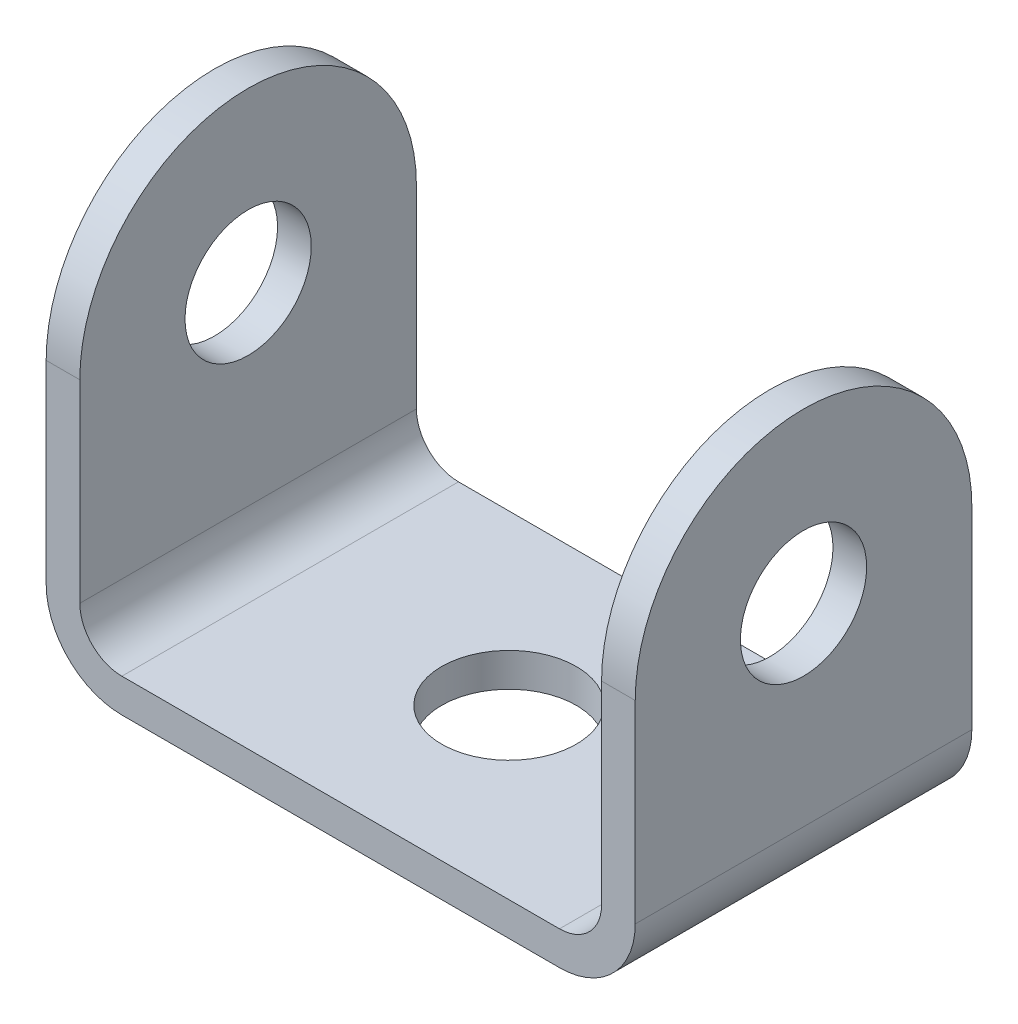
ISO-10303-21;
HEADER;
FILE_DESCRIPTION(('STEP AP214'),'2;1');
FILE_NAME('part.step','',(''),(''),'','','');
FILE_SCHEMA(('AUTOMOTIVE_DESIGN { 1 0 10303 214 1 1 1 1 }'));
ENDSEC;
DATA;
#1=APPLICATION_CONTEXT('core data for automotive mechanical design processes');
#2=APPLICATION_PROTOCOL_DEFINITION('international standard','automotive_design',2000,#1);
#3=PRODUCT_CONTEXT('',#1,'mechanical');
#4=PRODUCT('Part','Part','',(#3));
#5=PRODUCT_RELATED_PRODUCT_CATEGORY('part','',(#4));
#6=PRODUCT_DEFINITION_FORMATION('','',#4);
#7=PRODUCT_DEFINITION_CONTEXT('part definition',#1,'design');
#8=PRODUCT_DEFINITION('design','',#6,#7);
#9=PRODUCT_DEFINITION_SHAPE('','',#8);
#10=(LENGTH_UNIT() NAMED_UNIT(*) SI_UNIT(.MILLI.,.METRE.));
#11=(NAMED_UNIT(*) PLANE_ANGLE_UNIT() SI_UNIT($,.RADIAN.));
#12=(NAMED_UNIT(*) SI_UNIT($,.STERADIAN.) SOLID_ANGLE_UNIT());
#13=UNCERTAINTY_MEASURE_WITH_UNIT(LENGTH_MEASURE(1.E-05),#10,'distance_accuracy_value','');
#14=(GEOMETRIC_REPRESENTATION_CONTEXT(3) GLOBAL_UNCERTAINTY_ASSIGNED_CONTEXT((#13)) GLOBAL_UNIT_ASSIGNED_CONTEXT((#10,
#11,#12)) REPRESENTATION_CONTEXT('',''));
#15=CARTESIAN_POINT('',(0.,0.,0.));
#16=DIRECTION('',(0.,0.,1.));
#17=DIRECTION('',(1.,0.,0.));
#18=AXIS2_PLACEMENT_3D('',#15,#16,#17);
#19=CARTESIAN_POINT('',(31.,52.,20.));
#20=DIRECTION('',(1.,0.,0.));
#21=DIRECTION('',(0.,1.,0.));
#22=AXIS2_PLACEMENT_3D('',#19,#20,#21);
#23=PLANE('',#22);
#24=CARTESIAN_POINT('',(31.,32.,0.));
#25=DIRECTION('',(1.,0.,0.));
#26=DIRECTION('',(0.,1.,0.));
#27=AXIS2_PLACEMENT_3D('',#24,#25,#26);
#28=CIRCLE('',#27,7.5);
#29=CARTESIAN_POINT('',(31.,39.5,0.));
#30=VERTEX_POINT('',#29);
#31=EDGE_CURVE('E454',#30,#30,#28,.T.);
#32=ORIENTED_EDGE('',*,*,#31,.T.);
#33=EDGE_LOOP('',(#32));
#34=FACE_BOUND('',#33,.T.);
#35=DIRECTION('',(0.,-1.,0.));
#36=VECTOR('',#35,1.);
#37=CARTESIAN_POINT('',(31.,52.,20.));
#38=LINE('',#37,#36);
#39=CARTESIAN_POINT('',(31.,32.,20.));
#40=VERTEX_POINT('',#39);
#41=CARTESIAN_POINT('',(31.,9.00000000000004,20.));
#42=VERTEX_POINT('',#41);
#43=EDGE_CURVE('E520',#40,#42,#38,.T.);
#44=ORIENTED_EDGE('',*,*,#43,.F.);
#45=CARTESIAN_POINT('',(31.,32.,0.));
#46=DIRECTION('',(1.,0.,0.));
#47=DIRECTION('',(0.,1.,0.));
#48=AXIS2_PLACEMENT_3D('',#45,#46,#47);
#49=CIRCLE('',#48,20.);
#50=CARTESIAN_POINT('',(31.,32.,-20.));
#51=VERTEX_POINT('',#50);
#52=EDGE_CURVE('E438',#40,#51,#49,.F.);
#53=ORIENTED_EDGE('',*,*,#52,.T.);
#54=DIRECTION('',(0.,-1.,0.));
#55=VECTOR('',#54,1.);
#56=CARTESIAN_POINT('',(31.,52.,-20.));
#57=LINE('',#56,#55);
#58=CARTESIAN_POINT('',(31.,9.00000000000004,-20.));
#59=VERTEX_POINT('',#58);
#60=EDGE_CURVE('E498',#51,#59,#57,.T.);
#61=ORIENTED_EDGE('',*,*,#60,.T.);
#62=DIRECTION('',(0.,0.,-1.));
#63=VECTOR('',#62,1.);
#64=CARTESIAN_POINT('',(31.,9.00000000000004,20.));
#65=LINE('',#64,#63);
#66=EDGE_CURVE('E357',#42,#59,#65,.T.);
#67=ORIENTED_EDGE('',*,*,#66,.F.);
#68=EDGE_LOOP('',(#44,#53,#61,#67));
#69=FACE_BOUND('',#68,.T.);
#70=ADVANCED_FACE('F350',(#34,#69),#23,.F.);
#71=CARTESIAN_POINT('',(26.,9.,20.));
#72=DIRECTION('',(0.,0.,-1.));
#73=DIRECTION('',(-1.,0.,0.));
#74=AXIS2_PLACEMENT_3D('',#71,#72,#73);
#75=CYLINDRICAL_SURFACE('',#74,5.);
#76=CARTESIAN_POINT('',(26.,9.,-20.));
#77=DIRECTION('',(0.,0.,-1.));
#78=DIRECTION('',(-1.,0.,0.));
#79=AXIS2_PLACEMENT_3D('',#76,#77,#78);
#80=CIRCLE('',#79,5.);
#81=CARTESIAN_POINT('',(26.,4.,-20.));
#82=VERTEX_POINT('',#81);
#83=EDGE_CURVE('E491',#59,#82,#80,.T.);
#84=ORIENTED_EDGE('',*,*,#83,.T.);
#85=DIRECTION('',(0.,0.,-1.));
#86=VECTOR('',#85,1.);
#87=CARTESIAN_POINT('',(26.,4.,20.));
#88=LINE('',#87,#86);
#89=CARTESIAN_POINT('',(26.,4.,20.));
#90=VERTEX_POINT('',#89);
#91=EDGE_CURVE('E482',#90,#82,#88,.T.);
#92=ORIENTED_EDGE('',*,*,#91,.F.);
#93=CARTESIAN_POINT('',(26.,9.,20.));
#94=DIRECTION('',(0.,0.,-1.));
#95=DIRECTION('',(-1.,0.,0.));
#96=AXIS2_PLACEMENT_3D('',#93,#94,#95);
#97=CIRCLE('',#96,5.);
#98=EDGE_CURVE('E492',#42,#90,#97,.T.);
#99=ORIENTED_EDGE('',*,*,#98,.F.);
#100=ORIENTED_EDGE('',*,*,#66,.T.);
#101=EDGE_LOOP('',(#84,#92,#99,#100));
#102=FACE_BOUND('',#101,.T.);
#103=ADVANCED_FACE('F489',(#102),#75,.F.);
#104=CARTESIAN_POINT('',(26.,4.,20.));
#105=DIRECTION('',(0.,-1.,0.));
#106=DIRECTION('',(1.,0.,0.));
#107=AXIS2_PLACEMENT_3D('',#104,#105,#106);
#108=PLANE('',#107);
#109=CARTESIAN_POINT('',(0.,4.,0.));
#110=DIRECTION('',(0.,1.,0.));
#111=DIRECTION('',(-1.,0.,0.));
#112=AXIS2_PLACEMENT_3D('',#109,#110,#111);
#113=CIRCLE('',#112,8.);
#114=CARTESIAN_POINT('',(-8.,4.,0.));
#115=VERTEX_POINT('',#114);
#116=EDGE_CURVE('E562',#115,#115,#113,.T.);
#117=ORIENTED_EDGE('',*,*,#116,.F.);
#118=EDGE_LOOP('',(#117));
#119=FACE_BOUND('',#118,.T.);
#120=DIRECTION('',(-1.,0.,0.));
#121=VECTOR('',#120,1.);
#122=CARTESIAN_POINT('',(26.,4.,-20.));
#123=LINE('',#122,#121);
#124=CARTESIAN_POINT('',(-26.,3.99999999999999,-20.));
#125=VERTEX_POINT('',#124);
#126=EDGE_CURVE('E500',#82,#125,#123,.T.);
#127=ORIENTED_EDGE('',*,*,#126,.T.);
#128=DIRECTION('',(0.,0.,-1.));
#129=VECTOR('',#128,1.);
#130=CARTESIAN_POINT('',(-26.,3.99999999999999,20.));
#131=LINE('',#130,#129);
#132=CARTESIAN_POINT('',(-26.,3.99999999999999,20.));
#133=VERTEX_POINT('',#132);
#134=EDGE_CURVE('E479',#133,#125,#131,.T.);
#135=ORIENTED_EDGE('',*,*,#134,.F.);
#136=DIRECTION('',(-1.,0.,0.));
#137=VECTOR('',#136,1.);
#138=CARTESIAN_POINT('',(26.,4.,20.));
#139=LINE('',#138,#137);
#140=EDGE_CURVE('E523',#90,#133,#139,.T.);
#141=ORIENTED_EDGE('',*,*,#140,.F.);
#142=ORIENTED_EDGE('',*,*,#91,.T.);
#143=EDGE_LOOP('',(#127,#135,#141,#142));
#144=FACE_BOUND('',#143,.T.);
#145=ADVANCED_FACE('F568',(#119,#144),#108,.F.);
#146=CARTESIAN_POINT('',(-26.,8.99999999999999,20.));
#147=DIRECTION('',(0.,0.,-1.));
#148=DIRECTION('',(-1.,0.,0.));
#149=AXIS2_PLACEMENT_3D('',#146,#147,#148);
#150=CYLINDRICAL_SURFACE('',#149,5.);
#151=CARTESIAN_POINT('',(-26.,8.99999999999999,-20.));
#152=DIRECTION('',(0.,0.,-1.));
#153=DIRECTION('',(-1.,0.,0.));
#154=AXIS2_PLACEMENT_3D('',#151,#152,#153);
#155=CIRCLE('',#154,5.);
#156=CARTESIAN_POINT('',(-31.,9.00000000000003,-20.));
#157=VERTEX_POINT('',#156);
#158=EDGE_CURVE('E502',#125,#157,#155,.T.);
#159=ORIENTED_EDGE('',*,*,#158,.T.);
#160=DIRECTION('',(0.,0.,-1.));
#161=VECTOR('',#160,1.);
#162=CARTESIAN_POINT('',(-31.,9.00000000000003,20.));
#163=LINE('',#162,#161);
#164=CARTESIAN_POINT('',(-31.,9.00000000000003,20.));
#165=VERTEX_POINT('',#164);
#166=EDGE_CURVE('E476',#165,#157,#163,.T.);
#167=ORIENTED_EDGE('',*,*,#166,.F.);
#168=CARTESIAN_POINT('',(-26.,8.99999999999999,20.));
#169=DIRECTION('',(0.,0.,-1.));
#170=DIRECTION('',(-1.,0.,0.));
#171=AXIS2_PLACEMENT_3D('',#168,#169,#170);
#172=CIRCLE('',#171,5.);
#173=EDGE_CURVE('E525',#133,#165,#172,.T.);
#174=ORIENTED_EDGE('',*,*,#173,.F.);
#175=ORIENTED_EDGE('',*,*,#134,.T.);
#176=EDGE_LOOP('',(#159,#167,#174,#175));
#177=FACE_BOUND('',#176,.T.);
#178=ADVANCED_FACE('F571',(#177),#150,.F.);
#179=CARTESIAN_POINT('',(-31.,9.00000000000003,20.));
#180=DIRECTION('',(-1.,0.,0.));
#181=DIRECTION('',(0.,0.,1.));
#182=AXIS2_PLACEMENT_3D('',#179,#180,#181);
#183=PLANE('',#182);
#184=CARTESIAN_POINT('',(-31.,32.,0.));
#185=DIRECTION('',(-1.,0.,0.));
#186=DIRECTION('',(0.,0.,1.));
#187=AXIS2_PLACEMENT_3D('',#184,#185,#186);
#188=CIRCLE('',#187,7.5);
#189=CARTESIAN_POINT('',(-31.,32.,7.5));
#190=VERTEX_POINT('',#189);
#191=EDGE_CURVE('E550',#190,#190,#188,.T.);
#192=ORIENTED_EDGE('',*,*,#191,.T.);
#193=EDGE_LOOP('',(#192));
#194=FACE_BOUND('',#193,.T.);
#195=DIRECTION('',(0.,1.,0.));
#196=VECTOR('',#195,1.);
#197=CARTESIAN_POINT('',(-31.,9.00000000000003,-20.));
#198=LINE('',#197,#196);
#199=CARTESIAN_POINT('',(-31.,32.,-20.));
#200=VERTEX_POINT('',#199);
#201=EDGE_CURVE('E508',#157,#200,#198,.T.);
#202=ORIENTED_EDGE('',*,*,#201,.T.);
#203=CARTESIAN_POINT('',(-31.,32.,0.));
#204=DIRECTION('',(-1.,0.,0.));
#205=DIRECTION('',(0.,0.,1.));
#206=AXIS2_PLACEMENT_3D('',#203,#204,#205);
#207=CIRCLE('',#206,20.);
#208=CARTESIAN_POINT('',(-31.,32.,20.));
#209=VERTEX_POINT('',#208);
#210=EDGE_CURVE('E364',#200,#209,#207,.F.);
#211=ORIENTED_EDGE('',*,*,#210,.T.);
#212=DIRECTION('',(0.,1.,0.));
#213=VECTOR('',#212,1.);
#214=CARTESIAN_POINT('',(-31.,9.00000000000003,20.));
#215=LINE('',#214,#213);
#216=EDGE_CURVE('E527',#165,#209,#215,.T.);
#217=ORIENTED_EDGE('',*,*,#216,.F.);
#218=ORIENTED_EDGE('',*,*,#166,.T.);
#219=EDGE_LOOP('',(#202,#211,#217,#218));
#220=FACE_BOUND('',#219,.T.);
#221=ADVANCED_FACE('F581',(#194,#220),#183,.F.);
#222=CARTESIAN_POINT('',(-35.,9.00000000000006,20.));
#223=DIRECTION('',(1.,0.,0.));
#224=DIRECTION('',(0.,0.,-1.));
#225=AXIS2_PLACEMENT_3D('',#222,#223,#224);
#226=PLANE('',#225);
#227=CARTESIAN_POINT('',(-35.,32.,0.));
#228=DIRECTION('',(1.,0.,0.));
#229=DIRECTION('',(0.,0.,-1.));
#230=AXIS2_PLACEMENT_3D('',#227,#228,#229);
#231=CIRCLE('',#230,7.5);
#232=CARTESIAN_POINT('',(-35.,32.,-7.5));
#233=VERTEX_POINT('',#232);
#234=EDGE_CURVE('E553',#233,#233,#231,.T.);
#235=ORIENTED_EDGE('',*,*,#234,.T.);
#236=EDGE_LOOP('',(#235));
#237=FACE_BOUND('',#236,.T.);
#238=DIRECTION('',(0.,-1.,0.));
#239=VECTOR('',#238,1.);
#240=CARTESIAN_POINT('',(-35.,9.00000000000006,20.));
#241=LINE('',#240,#239);
#242=CARTESIAN_POINT('',(-35.,32.,20.));
#243=VERTEX_POINT('',#242);
#244=CARTESIAN_POINT('',(-35.,9.00000000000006,20.));
#245=VERTEX_POINT('',#244);
#246=EDGE_CURVE('E530',#243,#245,#241,.T.);
#247=ORIENTED_EDGE('',*,*,#246,.F.);
#248=CARTESIAN_POINT('',(-35.,32.,0.));
#249=DIRECTION('',(-1.,0.,0.));
#250=DIRECTION('',(0.,0.,-1.));
#251=AXIS2_PLACEMENT_3D('',#248,#249,#250);
#252=CIRCLE('',#251,20.);
#253=CARTESIAN_POINT('',(-35.,32.,-20.));
#254=VERTEX_POINT('',#253);
#255=EDGE_CURVE('E453',#243,#254,#252,.T.);
#256=ORIENTED_EDGE('',*,*,#255,.T.);
#257=DIRECTION('',(0.,-1.,0.));
#258=VECTOR('',#257,1.);
#259=CARTESIAN_POINT('',(-35.,9.00000000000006,-20.));
#260=LINE('',#259,#258);
#261=CARTESIAN_POINT('',(-35.,9.00000000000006,-20.));
#262=VERTEX_POINT('',#261);
#263=EDGE_CURVE('E511',#254,#262,#260,.T.);
#264=ORIENTED_EDGE('',*,*,#263,.T.);
#265=DIRECTION('',(0.,0.,-1.));
#266=VECTOR('',#265,1.);
#267=CARTESIAN_POINT('',(-35.,9.00000000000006,20.));
#268=LINE('',#267,#266);
#269=EDGE_CURVE('E473',#245,#262,#268,.T.);
#270=ORIENTED_EDGE('',*,*,#269,.F.);
#271=EDGE_LOOP('',(#247,#256,#264,#270));
#272=FACE_BOUND('',#271,.T.);
#273=ADVANCED_FACE('F587',(#237,#272),#226,.F.);
#274=CARTESIAN_POINT('',(-26.,9.,20.));
#275=DIRECTION('',(0.,0.,-1.));
#276=DIRECTION('',(-1.,0.,0.));
#277=AXIS2_PLACEMENT_3D('',#274,#275,#276);
#278=CYLINDRICAL_SURFACE('',#277,9.);
#279=CARTESIAN_POINT('',(-26.,9.,-20.));
#280=DIRECTION('',(0.,0.,1.));
#281=DIRECTION('',(-1.,0.,0.));
#282=AXIS2_PLACEMENT_3D('',#279,#280,#281);
#283=CIRCLE('',#282,9.);
#284=CARTESIAN_POINT('',(-25.9999999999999,0.,-20.));
#285=VERTEX_POINT('',#284);
#286=EDGE_CURVE('E513',#262,#285,#283,.T.);
#287=ORIENTED_EDGE('',*,*,#286,.T.);
#288=DIRECTION('',(0.,0.,-1.));
#289=VECTOR('',#288,1.);
#290=CARTESIAN_POINT('',(-25.9999999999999,0.,20.));
#291=LINE('',#290,#289);
#292=CARTESIAN_POINT('',(-25.9999999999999,0.,20.));
#293=VERTEX_POINT('',#292);
#294=EDGE_CURVE('E470',#293,#285,#291,.T.);
#295=ORIENTED_EDGE('',*,*,#294,.F.);
#296=CARTESIAN_POINT('',(-26.,9.,20.));
#297=DIRECTION('',(0.,0.,1.));
#298=DIRECTION('',(-1.,0.,0.));
#299=AXIS2_PLACEMENT_3D('',#296,#297,#298);
#300=CIRCLE('',#299,9.);
#301=EDGE_CURVE('E532',#245,#293,#300,.T.);
#302=ORIENTED_EDGE('',*,*,#301,.F.);
#303=ORIENTED_EDGE('',*,*,#269,.T.);
#304=EDGE_LOOP('',(#287,#295,#302,#303));
#305=FACE_BOUND('',#304,.T.);
#306=ADVANCED_FACE('F590',(#305),#278,.T.);
#307=CARTESIAN_POINT('',(-25.9999999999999,0.,20.));
#308=DIRECTION('',(0.,1.,0.));
#309=DIRECTION('',(0.,0.,1.));
#310=AXIS2_PLACEMENT_3D('',#307,#308,#309);
#311=PLANE('',#310);
#312=CARTESIAN_POINT('',(0.,0.,0.));
#313=DIRECTION('',(0.,1.,0.));
#314=DIRECTION('',(-1.,0.,0.));
#315=AXIS2_PLACEMENT_3D('',#312,#313,#314);
#316=CIRCLE('',#315,8.);
#317=CARTESIAN_POINT('',(-8.,0.,0.));
#318=VERTEX_POINT('',#317);
#319=EDGE_CURVE('E559',#318,#318,#316,.T.);
#320=ORIENTED_EDGE('',*,*,#319,.T.);
#321=EDGE_LOOP('',(#320));
#322=FACE_BOUND('',#321,.T.);
#323=DIRECTION('',(1.,0.,0.));
#324=VECTOR('',#323,1.);
#325=CARTESIAN_POINT('',(-25.9999999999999,0.,-20.));
#326=LINE('',#325,#324);
#327=CARTESIAN_POINT('',(25.9999999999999,0.,-20.));
#328=VERTEX_POINT('',#327);
#329=EDGE_CURVE('E515',#285,#328,#326,.T.);
#330=ORIENTED_EDGE('',*,*,#329,.T.);
#331=DIRECTION('',(0.,0.,-1.));
#332=VECTOR('',#331,1.);
#333=CARTESIAN_POINT('',(25.9999999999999,0.,20.));
#334=LINE('',#333,#332);
#335=CARTESIAN_POINT('',(25.9999999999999,0.,20.));
#336=VERTEX_POINT('',#335);
#337=EDGE_CURVE('E462',#336,#328,#334,.T.);
#338=ORIENTED_EDGE('',*,*,#337,.F.);
#339=DIRECTION('',(1.,0.,0.));
#340=VECTOR('',#339,1.);
#341=CARTESIAN_POINT('',(-25.9999999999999,0.,20.));
#342=LINE('',#341,#340);
#343=EDGE_CURVE('E464',#293,#336,#342,.T.);
#344=ORIENTED_EDGE('',*,*,#343,.F.);
#345=ORIENTED_EDGE('',*,*,#294,.T.);
#346=EDGE_LOOP('',(#330,#338,#344,#345));
#347=FACE_BOUND('',#346,.T.);
#348=ADVANCED_FACE('F538',(#322,#347),#311,.F.);
#349=CARTESIAN_POINT('',(26.,9.,20.));
#350=DIRECTION('',(0.,0.,-1.));
#351=DIRECTION('',(-1.,0.,0.));
#352=AXIS2_PLACEMENT_3D('',#349,#350,#351);
#353=CYLINDRICAL_SURFACE('',#352,9.);
#354=CARTESIAN_POINT('',(26.,9.,-20.));
#355=DIRECTION('',(0.,0.,1.));
#356=DIRECTION('',(-1.,0.,0.));
#357=AXIS2_PLACEMENT_3D('',#354,#355,#356);
#358=CIRCLE('',#357,9.);
#359=CARTESIAN_POINT('',(35.,9.00000000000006,-20.));
#360=VERTEX_POINT('',#359);
#361=EDGE_CURVE('E517',#328,#360,#358,.T.);
#362=ORIENTED_EDGE('',*,*,#361,.T.);
#363=DIRECTION('',(0.,0.,-1.));
#364=VECTOR('',#363,1.);
#365=CARTESIAN_POINT('',(35.,9.00000000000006,20.));
#366=LINE('',#365,#364);
#367=CARTESIAN_POINT('',(35.,9.00000000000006,20.));
#368=VERTEX_POINT('',#367);
#369=EDGE_CURVE('E460',#368,#360,#366,.T.);
#370=ORIENTED_EDGE('',*,*,#369,.F.);
#371=CARTESIAN_POINT('',(26.,9.,20.));
#372=DIRECTION('',(0.,0.,1.));
#373=DIRECTION('',(-1.,0.,0.));
#374=AXIS2_PLACEMENT_3D('',#371,#372,#373);
#375=CIRCLE('',#374,9.);
#376=EDGE_CURVE('E458',#336,#368,#375,.T.);
#377=ORIENTED_EDGE('',*,*,#376,.F.);
#378=ORIENTED_EDGE('',*,*,#337,.T.);
#379=EDGE_LOOP('',(#362,#370,#377,#378));
#380=FACE_BOUND('',#379,.T.);
#381=ADVANCED_FACE('F542',(#380),#353,.T.);
#382=CARTESIAN_POINT('',(35.,9.00000000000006,20.));
#383=DIRECTION('',(-1.,0.,0.));
#384=DIRECTION('',(0.,0.,1.));
#385=AXIS2_PLACEMENT_3D('',#382,#383,#384);
#386=PLANE('',#385);
#387=CARTESIAN_POINT('',(35.,32.,0.));
#388=DIRECTION('',(1.,0.,0.));
#389=DIRECTION('',(0.,0.,-1.));
#390=AXIS2_PLACEMENT_3D('',#387,#388,#389);
#391=CIRCLE('',#390,7.5);
#392=CARTESIAN_POINT('',(35.,32.,-7.5));
#393=VERTEX_POINT('',#392);
#394=EDGE_CURVE('E556',#393,#393,#391,.T.);
#395=ORIENTED_EDGE('',*,*,#394,.F.);
#396=EDGE_LOOP('',(#395));
#397=FACE_BOUND('',#396,.T.);
#398=DIRECTION('',(0.,1.,0.));
#399=VECTOR('',#398,1.);
#400=CARTESIAN_POINT('',(35.,9.00000000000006,-20.));
#401=LINE('',#400,#399);
#402=CARTESIAN_POINT('',(35.,32.,-20.));
#403=VERTEX_POINT('',#402);
#404=EDGE_CURVE('E452',#360,#403,#401,.T.);
#405=ORIENTED_EDGE('',*,*,#404,.T.);
#406=CARTESIAN_POINT('',(35.,32.,0.));
#407=DIRECTION('',(-1.,0.,0.));
#408=DIRECTION('',(0.,0.,-1.));
#409=AXIS2_PLACEMENT_3D('',#406,#407,#408);
#410=CIRCLE('',#409,20.);
#411=CARTESIAN_POINT('',(35.,32.,20.));
#412=VERTEX_POINT('',#411);
#413=EDGE_CURVE('E371',#412,#403,#410,.T.);
#414=ORIENTED_EDGE('',*,*,#413,.F.);
#415=DIRECTION('',(0.,1.,0.));
#416=VECTOR('',#415,1.);
#417=CARTESIAN_POINT('',(35.,9.00000000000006,20.));
#418=LINE('',#417,#416);
#419=EDGE_CURVE('E450',#368,#412,#418,.T.);
#420=ORIENTED_EDGE('',*,*,#419,.F.);
#421=ORIENTED_EDGE('',*,*,#369,.T.);
#422=EDGE_LOOP('',(#405,#414,#420,#421));
#423=FACE_BOUND('',#422,.T.);
#424=ADVANCED_FACE('F448',(#397,#423),#386,.F.);
#425=CARTESIAN_POINT('',(26.,9.,20.));
#426=DIRECTION('',(0.,0.,-1.));
#427=DIRECTION('',(-1.,0.,0.));
#428=AXIS2_PLACEMENT_3D('',#425,#426,#427);
#429=PLANE('',#428);
#430=ORIENTED_EDGE('',*,*,#419,.T.);
#431=DIRECTION('',(1.,0.,0.));
#432=VECTOR('',#431,1.);
#433=CARTESIAN_POINT('',(-35.,32.,20.));
#434=LINE('',#433,#432);
#435=EDGE_CURVE('E435',#40,#412,#434,.T.);
#436=ORIENTED_EDGE('',*,*,#435,.F.);
#437=ORIENTED_EDGE('',*,*,#43,.T.);
#438=ORIENTED_EDGE('',*,*,#98,.T.);
#439=ORIENTED_EDGE('',*,*,#140,.T.);
#440=ORIENTED_EDGE('',*,*,#173,.T.);
#441=ORIENTED_EDGE('',*,*,#216,.T.);
#442=EDGE_CURVE('E442',#243,#209,#434,.T.);
#443=ORIENTED_EDGE('',*,*,#442,.F.);
#444=ORIENTED_EDGE('',*,*,#246,.T.);
#445=ORIENTED_EDGE('',*,*,#301,.T.);
#446=ORIENTED_EDGE('',*,*,#343,.T.);
#447=ORIENTED_EDGE('',*,*,#376,.T.);
#448=EDGE_LOOP('',(#430,#436,#437,#438,#439,#440,#441,#443,#444,#445,#446,#447));
#449=FACE_BOUND('',#448,.T.);
#450=ADVANCED_FACE('F456',(#449),#429,.F.);
#451=CARTESIAN_POINT('',(26.,9.,-20.));
#452=DIRECTION('',(0.,0.,-1.));
#453=DIRECTION('',(-1.,0.,0.));
#454=AXIS2_PLACEMENT_3D('',#451,#452,#453);
#455=PLANE('',#454);
#456=DIRECTION('',(-1.,0.,0.));
#457=VECTOR('',#456,1.);
#458=CARTESIAN_POINT('',(26.,32.,-20.));
#459=LINE('',#458,#457);
#460=EDGE_CURVE('E11',#403,#51,#459,.T.);
#461=ORIENTED_EDGE('',*,*,#460,.F.);
#462=ORIENTED_EDGE('',*,*,#404,.F.);
#463=ORIENTED_EDGE('',*,*,#361,.F.);
#464=ORIENTED_EDGE('',*,*,#329,.F.);
#465=ORIENTED_EDGE('',*,*,#286,.F.);
#466=ORIENTED_EDGE('',*,*,#263,.F.);
#467=DIRECTION('',(1.,0.,0.));
#468=VECTOR('',#467,1.);
#469=CARTESIAN_POINT('',(-35.,32.,-20.));
#470=LINE('',#469,#468);
#471=EDGE_CURVE('E443',#254,#200,#470,.T.);
#472=ORIENTED_EDGE('',*,*,#471,.T.);
#473=ORIENTED_EDGE('',*,*,#201,.F.);
#474=ORIENTED_EDGE('',*,*,#158,.F.);
#475=ORIENTED_EDGE('',*,*,#126,.F.);
#476=ORIENTED_EDGE('',*,*,#83,.F.);
#477=ORIENTED_EDGE('',*,*,#60,.F.);
#478=EDGE_LOOP('',(#461,#462,#463,#464,#465,#466,#472,#473,#474,#475,#476,#477));
#479=FACE_BOUND('',#478,.T.);
#480=ADVANCED_FACE('F497',(#479),#455,.T.);
#481=CARTESIAN_POINT('',(-35.,32.,0.));
#482=DIRECTION('',(1.,0.,0.));
#483=DIRECTION('',(0.,0.,-1.));
#484=AXIS2_PLACEMENT_3D('',#481,#482,#483);
#485=CYLINDRICAL_SURFACE('',#484,20.);
#486=ORIENTED_EDGE('',*,*,#471,.F.);
#487=ORIENTED_EDGE('',*,*,#255,.F.);
#488=ORIENTED_EDGE('',*,*,#442,.T.);
#489=ORIENTED_EDGE('',*,*,#210,.F.);
#490=EDGE_LOOP('',(#486,#487,#488,#489));
#491=FACE_BOUND('',#490,.T.);
#492=ADVANCED_FACE('F618',(#491),#485,.T.);
#493=ORIENTED_EDGE('',*,*,#413,.T.);
#494=ORIENTED_EDGE('',*,*,#460,.T.);
#495=ORIENTED_EDGE('',*,*,#52,.F.);
#496=ORIENTED_EDGE('',*,*,#435,.T.);
#497=EDGE_LOOP('',(#493,#494,#495,#496));
#498=FACE_BOUND('',#497,.T.);
#499=ADVANCED_FACE('F436',(#498),#485,.T.);
#500=CARTESIAN_POINT('',(-35.,32.,0.));
#501=DIRECTION('',(1.,0.,0.));
#502=DIRECTION('',(0.,0.,-1.));
#503=AXIS2_PLACEMENT_3D('',#500,#501,#502);
#504=CYLINDRICAL_SURFACE('',#503,7.5);
#505=ORIENTED_EDGE('',*,*,#394,.T.);
#506=EDGE_LOOP('',(#505));
#507=FACE_BOUND('',#506,.T.);
#508=ORIENTED_EDGE('',*,*,#31,.F.);
#509=EDGE_LOOP('',(#508));
#510=FACE_BOUND('',#509,.T.);
#511=ADVANCED_FACE('F608',(#507,#510),#504,.F.);
#512=ORIENTED_EDGE('',*,*,#234,.F.);
#513=EDGE_LOOP('',(#512));
#514=FACE_BOUND('',#513,.T.);
#515=ORIENTED_EDGE('',*,*,#191,.F.);
#516=EDGE_LOOP('',(#515));
#517=FACE_BOUND('',#516,.T.);
#518=ADVANCED_FACE('F610',(#514,#517),#504,.F.);
#519=CARTESIAN_POINT('',(0.,0.,0.));
#520=DIRECTION('',(0.,1.,0.));
#521=DIRECTION('',(-1.,0.,0.));
#522=AXIS2_PLACEMENT_3D('',#519,#520,#521);
#523=CYLINDRICAL_SURFACE('',#522,8.);
#524=ORIENTED_EDGE('',*,*,#319,.F.);
#525=EDGE_LOOP('',(#524));
#526=FACE_BOUND('',#525,.T.);
#527=ORIENTED_EDGE('',*,*,#116,.T.);
#528=EDGE_LOOP('',(#527));
#529=FACE_BOUND('',#528,.T.);
#530=ADVANCED_FACE('F566',(#526,#529),#523,.F.);
#531=CLOSED_SHELL('',(#70,#103,#145,#178,#221,#273,#306,#348,#381,#424,#450,#480,#492,#499,#511,
#518,#530));
#532=MANIFOLD_SOLID_BREP('B2',#531);
#533=ADVANCED_BREP_SHAPE_REPRESENTATION('',(#18,#532),#14);
#534=SHAPE_DEFINITION_REPRESENTATION(#9,#533);
ENDSEC;
END-ISO-10303-21;
